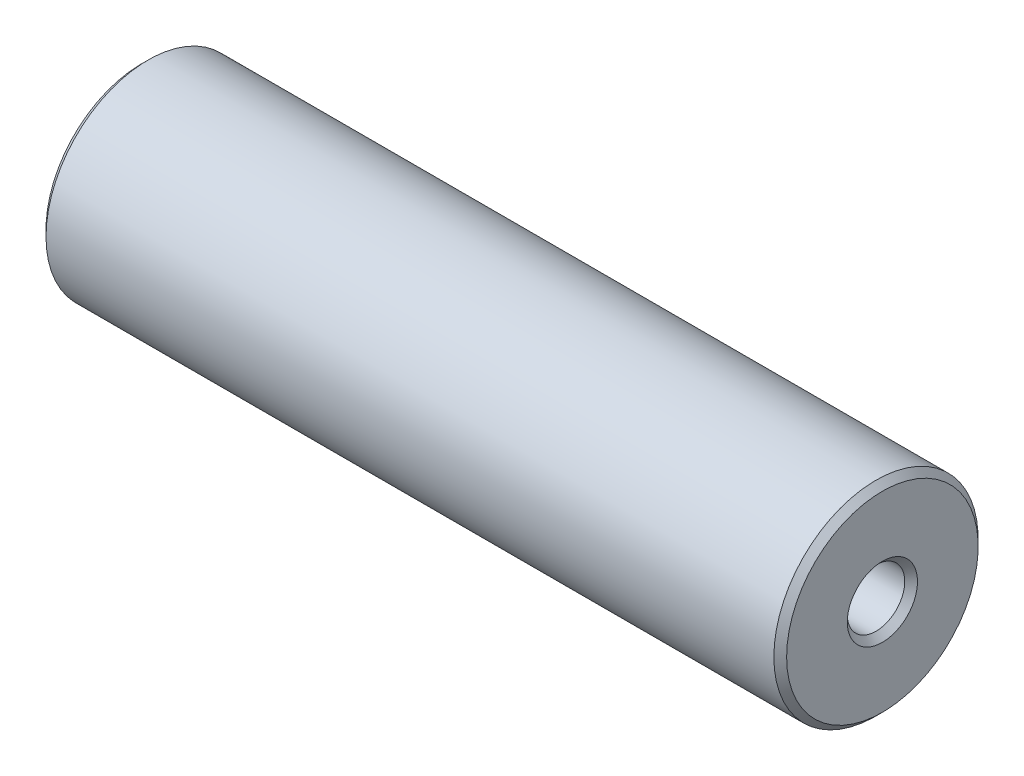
ISO-10303-21;
HEADER;
FILE_DESCRIPTION(('STEP AP214'),'2;1');
FILE_NAME('part.step','',(''),(''),'','','');
FILE_SCHEMA(('AUTOMOTIVE_DESIGN { 1 0 10303 214 1 1 1 1 }'));
ENDSEC;
DATA;
#1=APPLICATION_CONTEXT('core data for automotive mechanical design processes');
#2=APPLICATION_PROTOCOL_DEFINITION('international standard','automotive_design',2000,#1);
#3=PRODUCT_CONTEXT('',#1,'mechanical');
#4=PRODUCT('Part','Part','',(#3));
#5=PRODUCT_RELATED_PRODUCT_CATEGORY('part','',(#4));
#6=PRODUCT_DEFINITION_FORMATION('','',#4);
#7=PRODUCT_DEFINITION_CONTEXT('part definition',#1,'design');
#8=PRODUCT_DEFINITION('design','',#6,#7);
#9=PRODUCT_DEFINITION_SHAPE('','',#8);
#10=(LENGTH_UNIT() NAMED_UNIT(*) SI_UNIT(.MILLI.,.METRE.));
#11=(NAMED_UNIT(*) PLANE_ANGLE_UNIT() SI_UNIT($,.RADIAN.));
#12=(NAMED_UNIT(*) SI_UNIT($,.STERADIAN.) SOLID_ANGLE_UNIT());
#13=UNCERTAINTY_MEASURE_WITH_UNIT(LENGTH_MEASURE(1.E-05),#10,'distance_accuracy_value','');
#14=(GEOMETRIC_REPRESENTATION_CONTEXT(3) GLOBAL_UNCERTAINTY_ASSIGNED_CONTEXT((#13)) GLOBAL_UNIT_ASSIGNED_CONTEXT((#10,
#11,#12)) REPRESENTATION_CONTEXT('',''));
#15=CARTESIAN_POINT('',(0.,0.,0.));
#16=DIRECTION('',(0.,0.,1.));
#17=DIRECTION('',(1.,0.,0.));
#18=AXIS2_PLACEMENT_3D('',#15,#16,#17);
#19=CARTESIAN_POINT('',(0.,0.,0.));
#20=DIRECTION('',(-1.,0.,0.));
#21=DIRECTION('',(0.,0.,1.));
#22=AXIS2_PLACEMENT_3D('',#19,#20,#21);
#23=CYLINDRICAL_SURFACE('',#22,7.5);
#24=CARTESIAN_POINT('',(0.999999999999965,0.,0.));
#25=DIRECTION('',(1.,0.,0.));
#26=DIRECTION('',(0.,0.,-1.));
#27=AXIS2_PLACEMENT_3D('',#24,#25,#26);
#28=CIRCLE('',#27,7.5);
#29=CARTESIAN_POINT('',(0.999999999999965,0.,-7.5));
#30=VERTEX_POINT('',#29);
#31=EDGE_CURVE('E25',#30,#30,#28,.F.);
#32=ORIENTED_EDGE('',*,*,#31,.T.);
#33=EDGE_LOOP('',(#32));
#34=FACE_BOUND('',#33,.T.);
#35=CARTESIAN_POINT('',(9.,0.,0.));
#36=DIRECTION('',(-1.,0.,0.));
#37=DIRECTION('',(0.,0.,1.));
#38=AXIS2_PLACEMENT_3D('',#35,#36,#37);
#39=CIRCLE('',#38,7.5);
#40=CARTESIAN_POINT('',(9.,0.,7.5));
#41=VERTEX_POINT('',#40);
#42=EDGE_CURVE('E49',#41,#41,#39,.T.);
#43=ORIENTED_EDGE('',*,*,#42,.F.);
#44=EDGE_LOOP('',(#43));
#45=FACE_BOUND('',#44,.T.);
#46=ADVANCED_FACE('F14',(#34,#45),#23,.F.);
#47=CARTESIAN_POINT('',(0.,7.5,0.));
#48=DIRECTION('',(1.,0.,0.));
#49=DIRECTION('',(0.,0.,-1.));
#50=AXIS2_PLACEMENT_3D('',#47,#48,#49);
#51=PLANE('',#50);
#52=CARTESIAN_POINT('',(0.,0.,0.));
#53=DIRECTION('',(1.,0.,0.));
#54=DIRECTION('',(0.,0.,-1.));
#55=AXIS2_PLACEMENT_3D('',#52,#53,#54);
#56=CIRCLE('',#55,15.);
#57=CARTESIAN_POINT('',(0.,0.,-15.));
#58=VERTEX_POINT('',#57);
#59=EDGE_CURVE('E34',#58,#58,#56,.F.);
#60=ORIENTED_EDGE('',*,*,#59,.T.);
#61=EDGE_LOOP('',(#60));
#62=FACE_BOUND('',#61,.T.);
#63=CARTESIAN_POINT('',(0.,0.,0.));
#64=DIRECTION('',(1.,0.,0.));
#65=DIRECTION('',(0.,0.,-1.));
#66=AXIS2_PLACEMENT_3D('',#63,#64,#65);
#67=CIRCLE('',#66,8.5);
#68=CARTESIAN_POINT('',(0.,0.,-8.5));
#69=VERTEX_POINT('',#68);
#70=EDGE_CURVE('E37',#69,#69,#67,.T.);
#71=ORIENTED_EDGE('',*,*,#70,.T.);
#72=EDGE_LOOP('',(#71));
#73=FACE_BOUND('',#72,.T.);
#74=ADVANCED_FACE('F56',(#62,#73),#51,.F.);
#75=CARTESIAN_POINT('',(0.,0.,0.));
#76=DIRECTION('',(-1.,0.,0.));
#77=DIRECTION('',(0.,0.,1.));
#78=AXIS2_PLACEMENT_3D('',#75,#76,#77);
#79=CYLINDRICAL_SURFACE('',#78,16.);
#80=CARTESIAN_POINT('',(0.999999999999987,0.,0.));
#81=DIRECTION('',(1.,0.,0.));
#82=DIRECTION('',(0.,0.,-1.));
#83=AXIS2_PLACEMENT_3D('',#80,#81,#82);
#84=CIRCLE('',#83,16.);
#85=CARTESIAN_POINT('',(0.999999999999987,0.,-16.));
#86=VERTEX_POINT('',#85);
#87=EDGE_CURVE('E29',#86,#86,#84,.T.);
#88=ORIENTED_EDGE('',*,*,#87,.T.);
#89=EDGE_LOOP('',(#88));
#90=FACE_BOUND('',#89,.T.);
#91=CARTESIAN_POINT('',(115.,0.,0.));
#92=DIRECTION('',(-1.,0.,0.));
#93=DIRECTION('',(0.,0.,1.));
#94=AXIS2_PLACEMENT_3D('',#91,#92,#93);
#95=CIRCLE('',#94,16.);
#96=CARTESIAN_POINT('',(115.,0.,16.));
#97=VERTEX_POINT('',#96);
#98=EDGE_CURVE('E43',#97,#97,#95,.T.);
#99=ORIENTED_EDGE('',*,*,#98,.T.);
#100=EDGE_LOOP('',(#99));
#101=FACE_BOUND('',#100,.T.);
#102=ADVANCED_FACE('F64',(#90,#101),#79,.T.);
#103=CARTESIAN_POINT('',(116.,16.,0.));
#104=DIRECTION('',(-1.,0.,0.));
#105=DIRECTION('',(0.,0.,1.));
#106=AXIS2_PLACEMENT_3D('',#103,#104,#105);
#107=PLANE('',#106);
#108=CARTESIAN_POINT('',(116.,0.,0.));
#109=DIRECTION('',(-1.,0.,0.));
#110=DIRECTION('',(0.,0.,1.));
#111=AXIS2_PLACEMENT_3D('',#108,#109,#110);
#112=CIRCLE('',#111,5.5);
#113=CARTESIAN_POINT('',(116.,0.,5.5));
#114=VERTEX_POINT('',#113);
#115=EDGE_CURVE('E21',#114,#114,#112,.T.);
#116=ORIENTED_EDGE('',*,*,#115,.T.);
#117=EDGE_LOOP('',(#116));
#118=FACE_BOUND('',#117,.T.);
#119=CARTESIAN_POINT('',(116.,0.,0.));
#120=DIRECTION('',(-1.,0.,0.));
#121=DIRECTION('',(0.,0.,1.));
#122=AXIS2_PLACEMENT_3D('',#119,#120,#121);
#123=CIRCLE('',#122,15.);
#124=CARTESIAN_POINT('',(116.,0.,15.));
#125=VERTEX_POINT('',#124);
#126=EDGE_CURVE('E40',#125,#125,#123,.F.);
#127=ORIENTED_EDGE('',*,*,#126,.T.);
#128=EDGE_LOOP('',(#127));
#129=FACE_BOUND('',#128,.T.);
#130=ADVANCED_FACE('F110',(#118,#129),#107,.F.);
#131=CARTESIAN_POINT('',(0.,0.,0.));
#132=DIRECTION('',(-1.,0.,0.));
#133=DIRECTION('',(0.,0.,1.));
#134=AXIS2_PLACEMENT_3D('',#131,#132,#133);
#135=CYLINDRICAL_SURFACE('',#134,4.5);
#136=CARTESIAN_POINT('',(115.,0.,0.));
#137=DIRECTION('',(-1.,0.,0.));
#138=DIRECTION('',(0.,0.,1.));
#139=AXIS2_PLACEMENT_3D('',#136,#137,#138);
#140=CIRCLE('',#139,4.5);
#141=CARTESIAN_POINT('',(115.,0.,4.5));
#142=VERTEX_POINT('',#141);
#143=EDGE_CURVE('E9',#142,#142,#140,.F.);
#144=ORIENTED_EDGE('',*,*,#143,.T.);
#145=EDGE_LOOP('',(#144));
#146=FACE_BOUND('',#145,.T.);
#147=CARTESIAN_POINT('',(9.,0.,0.));
#148=DIRECTION('',(-1.,0.,0.));
#149=DIRECTION('',(0.,0.,1.));
#150=AXIS2_PLACEMENT_3D('',#147,#148,#149);
#151=CIRCLE('',#150,4.5);
#152=CARTESIAN_POINT('',(9.,0.,4.5));
#153=VERTEX_POINT('',#152);
#154=EDGE_CURVE('E46',#153,#153,#151,.T.);
#155=ORIENTED_EDGE('',*,*,#154,.T.);
#156=EDGE_LOOP('',(#155));
#157=FACE_BOUND('',#156,.T.);
#158=ADVANCED_FACE('F105',(#146,#157),#135,.F.);
#159=CARTESIAN_POINT('',(9.,7.5,0.));
#160=DIRECTION('',(1.,0.,0.));
#161=DIRECTION('',(0.,0.,-1.));
#162=AXIS2_PLACEMENT_3D('',#159,#160,#161);
#163=PLANE('',#162);
#164=ORIENTED_EDGE('',*,*,#154,.F.);
#165=EDGE_LOOP('',(#164));
#166=FACE_BOUND('',#165,.T.);
#167=ORIENTED_EDGE('',*,*,#42,.T.);
#168=EDGE_LOOP('',(#167));
#169=FACE_BOUND('',#168,.T.);
#170=ADVANCED_FACE('F53',(#166,#169),#163,.F.);
#171=CARTESIAN_POINT('',(115.,0.,0.));
#172=DIRECTION('',(-1.,0.,0.));
#173=DIRECTION('',(0.,0.,1.));
#174=AXIS2_PLACEMENT_3D('',#171,#172,#173);
#175=CONICAL_SURFACE('',#174,16.,0.785398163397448);
#176=ORIENTED_EDGE('',*,*,#126,.F.);
#177=EDGE_LOOP('',(#176));
#178=FACE_BOUND('',#177,.T.);
#179=ORIENTED_EDGE('',*,*,#98,.F.);
#180=EDGE_LOOP('',(#179));
#181=FACE_BOUND('',#180,.T.);
#182=ADVANCED_FACE('F69',(#178,#181),#175,.T.);
#183=CARTESIAN_POINT('',(0.,0.,0.));
#184=DIRECTION('',(1.,0.,0.));
#185=DIRECTION('',(0.,0.,-1.));
#186=AXIS2_PLACEMENT_3D('',#183,#184,#185);
#187=CONICAL_SURFACE('',#186,15.,0.785398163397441);
#188=ORIENTED_EDGE('',*,*,#87,.F.);
#189=EDGE_LOOP('',(#188));
#190=FACE_BOUND('',#189,.T.);
#191=ORIENTED_EDGE('',*,*,#59,.F.);
#192=EDGE_LOOP('',(#191));
#193=FACE_BOUND('',#192,.T.);
#194=ADVANCED_FACE('F72',(#190,#193),#187,.T.);
#195=CARTESIAN_POINT('',(0.999999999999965,0.,0.));
#196=DIRECTION('',(-1.,0.,0.));
#197=DIRECTION('',(0.,0.,1.));
#198=AXIS2_PLACEMENT_3D('',#195,#196,#197);
#199=CONICAL_SURFACE('',#198,7.5,0.785398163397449);
#200=ORIENTED_EDGE('',*,*,#70,.F.);
#201=EDGE_LOOP('',(#200));
#202=FACE_BOUND('',#201,.T.);
#203=ORIENTED_EDGE('',*,*,#31,.F.);
#204=EDGE_LOOP('',(#203));
#205=FACE_BOUND('',#204,.T.);
#206=ADVANCED_FACE('F75',(#202,#205),#199,.F.);
#207=CARTESIAN_POINT('',(116.,0.,0.));
#208=DIRECTION('',(1.,0.,0.));
#209=DIRECTION('',(0.,0.,-1.));
#210=AXIS2_PLACEMENT_3D('',#207,#208,#209);
#211=CONICAL_SURFACE('',#210,5.5,0.785398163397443);
#212=ORIENTED_EDGE('',*,*,#143,.F.);
#213=EDGE_LOOP('',(#212));
#214=FACE_BOUND('',#213,.T.);
#215=ORIENTED_EDGE('',*,*,#115,.F.);
#216=EDGE_LOOP('',(#215));
#217=FACE_BOUND('',#216,.T.);
#218=ADVANCED_FACE('F16',(#214,#217),#211,.F.);
#219=CLOSED_SHELL('',(#46,#74,#102,#130,#158,#170,#182,#194,#206,#218));
#220=MANIFOLD_SOLID_BREP('B1',#219);
#221=ADVANCED_BREP_SHAPE_REPRESENTATION('',(#18,#220),#14);
#222=SHAPE_DEFINITION_REPRESENTATION(#9,#221);
ENDSEC;
END-ISO-10303-21;
